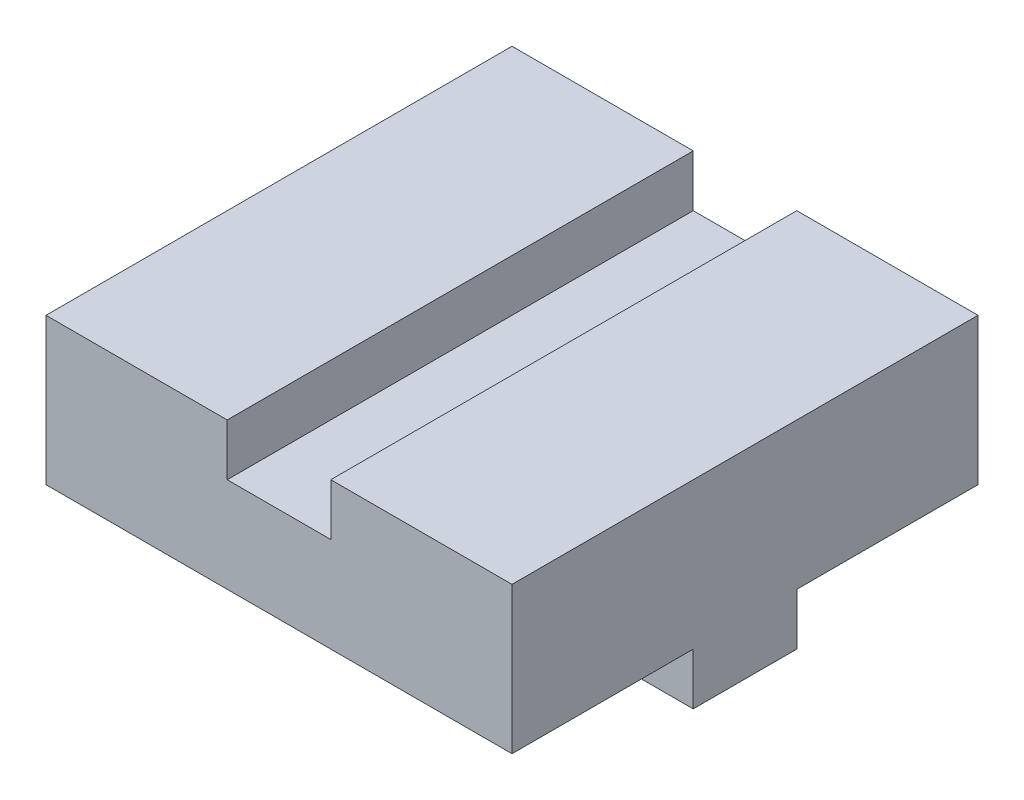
ISO-10303-21;
HEADER;
FILE_DESCRIPTION(('STEP AP214'),'2;1');
FILE_NAME('part.step','',(''),(''),'','','');
FILE_SCHEMA(('AUTOMOTIVE_DESIGN { 1 0 10303 214 1 1 1 1 }'));
ENDSEC;
DATA;
#1=APPLICATION_CONTEXT('core data for automotive mechanical design processes');
#2=APPLICATION_PROTOCOL_DEFINITION('international standard','automotive_design',2000,#1);
#3=PRODUCT_CONTEXT('',#1,'mechanical');
#4=PRODUCT('Part','Part','',(#3));
#5=PRODUCT_RELATED_PRODUCT_CATEGORY('part','',(#4));
#6=PRODUCT_DEFINITION_FORMATION('','',#4);
#7=PRODUCT_DEFINITION_CONTEXT('part definition',#1,'design');
#8=PRODUCT_DEFINITION('design','',#6,#7);
#9=PRODUCT_DEFINITION_SHAPE('','',#8);
#10=(LENGTH_UNIT() NAMED_UNIT(*) SI_UNIT(.MILLI.,.METRE.));
#11=(NAMED_UNIT(*) PLANE_ANGLE_UNIT() SI_UNIT($,.RADIAN.));
#12=(NAMED_UNIT(*) SI_UNIT($,.STERADIAN.) SOLID_ANGLE_UNIT());
#13=UNCERTAINTY_MEASURE_WITH_UNIT(LENGTH_MEASURE(1.E-05),#10,'distance_accuracy_value','');
#14=(GEOMETRIC_REPRESENTATION_CONTEXT(3) GLOBAL_UNCERTAINTY_ASSIGNED_CONTEXT((#13)) GLOBAL_UNIT_ASSIGNED_CONTEXT((#10,
#11,#12)) REPRESENTATION_CONTEXT('',''));
#15=CARTESIAN_POINT('',(0.,0.,0.));
#16=DIRECTION('',(0.,0.,1.));
#17=DIRECTION('',(1.,0.,0.));
#18=AXIS2_PLACEMENT_3D('',#15,#16,#17);
#19=CARTESIAN_POINT('',(0.,0.,0.));
#20=DIRECTION('',(0.,1.,0.));
#21=DIRECTION('',(0.,0.,1.));
#22=AXIS2_PLACEMENT_3D('',#19,#20,#21);
#23=PLANE('',#22);
#24=DIRECTION('',(1.,0.,0.));
#25=VECTOR('',#24,1.);
#26=CARTESIAN_POINT('',(-67.3606797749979,0.,-10.));
#27=LINE('',#26,#25);
#28=CARTESIAN_POINT('',(-45.,0.,-9.99999999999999));
#29=VERTEX_POINT('',#28);
#30=CARTESIAN_POINT('',(45.,0.,-10.));
#31=VERTEX_POINT('',#30);
#32=EDGE_CURVE('E176',#29,#31,#27,.T.);
#33=ORIENTED_EDGE('',*,*,#32,.F.);
#34=DIRECTION('',(0.,0.,1.));
#35=VECTOR('',#34,1.);
#36=CARTESIAN_POINT('',(-45.,0.,45.));
#37=LINE('',#36,#35);
#38=CARTESIAN_POINT('',(-45.,0.,-45.));
#39=VERTEX_POINT('',#38);
#40=EDGE_CURVE('E240',#39,#29,#37,.T.);
#41=ORIENTED_EDGE('',*,*,#40,.F.);
#42=DIRECTION('',(-1.,0.,0.));
#43=VECTOR('',#42,1.);
#44=CARTESIAN_POINT('',(45.,0.,-45.));
#45=LINE('',#44,#43);
#46=CARTESIAN_POINT('',(45.,0.,-45.));
#47=VERTEX_POINT('',#46);
#48=EDGE_CURVE('E226',#47,#39,#45,.T.);
#49=ORIENTED_EDGE('',*,*,#48,.F.);
#50=DIRECTION('',(0.,0.,-1.));
#51=VECTOR('',#50,1.);
#52=CARTESIAN_POINT('',(45.,0.,45.));
#53=LINE('',#52,#51);
#54=EDGE_CURVE('E247',#31,#47,#53,.T.);
#55=ORIENTED_EDGE('',*,*,#54,.F.);
#56=EDGE_LOOP('',(#33,#41,#49,#55));
#57=FACE_BOUND('',#56,.T.);
#58=ADVANCED_FACE('F51',(#57),#23,.F.);
#59=CARTESIAN_POINT('',(0.,28.3333333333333,0.));
#60=DIRECTION('',(0.,1.,0.));
#61=DIRECTION('',(0.,0.,1.));
#62=AXIS2_PLACEMENT_3D('',#59,#60,#61);
#63=PLANE('',#62);
#64=DIRECTION('',(0.,0.,1.));
#65=VECTOR('',#64,1.);
#66=CARTESIAN_POINT('',(-9.99999999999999,28.3333333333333,-45.));
#67=LINE('',#66,#65);
#68=CARTESIAN_POINT('',(-9.99999999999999,28.3333333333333,-45.));
#69=VERTEX_POINT('',#68);
#70=CARTESIAN_POINT('',(-9.99999999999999,28.3333333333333,45.));
#71=VERTEX_POINT('',#70);
#72=EDGE_CURVE('E209',#69,#71,#67,.T.);
#73=ORIENTED_EDGE('',*,*,#72,.F.);
#74=DIRECTION('',(-1.,0.,0.));
#75=VECTOR('',#74,1.);
#76=CARTESIAN_POINT('',(45.,28.3333333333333,-45.));
#77=LINE('',#76,#75);
#78=CARTESIAN_POINT('',(-45.,28.3333333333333,-45.));
#79=VERTEX_POINT('',#78);
#80=EDGE_CURVE('E234',#69,#79,#77,.T.);
#81=ORIENTED_EDGE('',*,*,#80,.T.);
#82=DIRECTION('',(0.,0.,1.));
#83=VECTOR('',#82,1.);
#84=CARTESIAN_POINT('',(-45.,28.3333333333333,45.));
#85=LINE('',#84,#83);
#86=CARTESIAN_POINT('',(-45.,28.3333333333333,45.));
#87=VERTEX_POINT('',#86);
#88=EDGE_CURVE('E221',#79,#87,#85,.T.);
#89=ORIENTED_EDGE('',*,*,#88,.T.);
#90=DIRECTION('',(1.,0.,0.));
#91=VECTOR('',#90,1.);
#92=CARTESIAN_POINT('',(45.,28.3333333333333,45.));
#93=LINE('',#92,#91);
#94=EDGE_CURVE('E227',#87,#71,#93,.T.);
#95=ORIENTED_EDGE('',*,*,#94,.T.);
#96=EDGE_LOOP('',(#73,#81,#89,#95));
#97=FACE_BOUND('',#96,.T.);
#98=ADVANCED_FACE('F287',(#97),#63,.T.);
#99=CARTESIAN_POINT('',(-45.,28.3333333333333,45.));
#100=DIRECTION('',(1.,0.,0.));
#101=DIRECTION('',(0.,0.,-1.));
#102=AXIS2_PLACEMENT_3D('',#99,#100,#101);
#103=PLANE('',#102);
#104=ORIENTED_EDGE('',*,*,#40,.T.);
#105=DIRECTION('',(0.,-1.,0.));
#106=VECTOR('',#105,1.);
#107=CARTESIAN_POINT('',(-45.,0.,-10.));
#108=LINE('',#107,#106);
#109=CARTESIAN_POINT('',(-45.,-10.,-10.));
#110=VERTEX_POINT('',#109);
#111=EDGE_CURVE('E175',#29,#110,#108,.T.);
#112=ORIENTED_EDGE('',*,*,#111,.T.);
#113=DIRECTION('',(0.,0.,1.));
#114=VECTOR('',#113,1.);
#115=CARTESIAN_POINT('',(-45.,-10.,10.));
#116=LINE('',#115,#114);
#117=CARTESIAN_POINT('',(-45.,-10.,10.));
#118=VERTEX_POINT('',#117);
#119=EDGE_CURVE('E182',#110,#118,#116,.T.);
#120=ORIENTED_EDGE('',*,*,#119,.T.);
#121=DIRECTION('',(0.,1.,0.));
#122=VECTOR('',#121,1.);
#123=CARTESIAN_POINT('',(-45.,0.,10.));
#124=LINE('',#123,#122);
#125=CARTESIAN_POINT('',(-45.,0.,10.));
#126=VERTEX_POINT('',#125);
#127=EDGE_CURVE('E147',#118,#126,#124,.T.);
#128=ORIENTED_EDGE('',*,*,#127,.T.);
#129=CARTESIAN_POINT('',(-45.,0.,45.));
#130=VERTEX_POINT('',#129);
#131=EDGE_CURVE('E72',#126,#130,#37,.T.);
#132=ORIENTED_EDGE('',*,*,#131,.T.);
#133=DIRECTION('',(0.,-1.,0.));
#134=VECTOR('',#133,1.);
#135=CARTESIAN_POINT('',(-45.,28.3333333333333,45.));
#136=LINE('',#135,#134);
#137=EDGE_CURVE('E11',#87,#130,#136,.T.);
#138=ORIENTED_EDGE('',*,*,#137,.F.);
#139=ORIENTED_EDGE('',*,*,#88,.F.);
#140=DIRECTION('',(0.,-1.,0.));
#141=VECTOR('',#140,1.);
#142=CARTESIAN_POINT('',(-45.,28.3333333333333,-45.));
#143=LINE('',#142,#141);
#144=EDGE_CURVE('E239',#79,#39,#143,.T.);
#145=ORIENTED_EDGE('',*,*,#144,.T.);
#146=EDGE_LOOP('',(#104,#112,#120,#128,#132,#138,#139,#145));
#147=FACE_BOUND('',#146,.T.);
#148=ADVANCED_FACE('F53',(#147),#103,.F.);
#149=CARTESIAN_POINT('',(45.,28.3333333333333,45.));
#150=DIRECTION('',(0.,0.,-1.));
#151=DIRECTION('',(-1.,0.,0.));
#152=AXIS2_PLACEMENT_3D('',#149,#150,#151);
#153=PLANE('',#152);
#154=DIRECTION('',(1.,0.,0.));
#155=VECTOR('',#154,1.);
#156=CARTESIAN_POINT('',(-10.,18.3333333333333,45.));
#157=LINE('',#156,#155);
#158=CARTESIAN_POINT('',(-10.,18.3333333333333,45.));
#159=VERTEX_POINT('',#158);
#160=CARTESIAN_POINT('',(10.,18.3333333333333,45.));
#161=VERTEX_POINT('',#160);
#162=EDGE_CURVE('E203',#159,#161,#157,.T.);
#163=ORIENTED_EDGE('',*,*,#162,.F.);
#164=DIRECTION('',(0.,-1.,0.));
#165=VECTOR('',#164,1.);
#166=CARTESIAN_POINT('',(-9.99999999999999,28.3333333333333,45.));
#167=LINE('',#166,#165);
#168=EDGE_CURVE('E185',#71,#159,#167,.T.);
#169=ORIENTED_EDGE('',*,*,#168,.F.);
#170=ORIENTED_EDGE('',*,*,#94,.F.);
#171=ORIENTED_EDGE('',*,*,#137,.T.);
#172=DIRECTION('',(1.,0.,0.));
#173=VECTOR('',#172,1.);
#174=CARTESIAN_POINT('',(45.,0.,45.));
#175=LINE('',#174,#173);
#176=CARTESIAN_POINT('',(45.,0.,45.));
#177=VERTEX_POINT('',#176);
#178=EDGE_CURVE('E244',#130,#177,#175,.T.);
#179=ORIENTED_EDGE('',*,*,#178,.T.);
#180=DIRECTION('',(0.,-1.,0.));
#181=VECTOR('',#180,1.);
#182=CARTESIAN_POINT('',(45.,28.3333333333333,45.));
#183=LINE('',#182,#181);
#184=CARTESIAN_POINT('',(45.,28.3333333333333,45.));
#185=VERTEX_POINT('',#184);
#186=EDGE_CURVE('E60',#185,#177,#183,.T.);
#187=ORIENTED_EDGE('',*,*,#186,.F.);
#188=CARTESIAN_POINT('',(10.,28.3333333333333,45.));
#189=VERTEX_POINT('',#188);
#190=EDGE_CURVE('E225',#189,#185,#93,.T.);
#191=ORIENTED_EDGE('',*,*,#190,.F.);
#192=DIRECTION('',(0.,1.,0.));
#193=VECTOR('',#192,1.);
#194=CARTESIAN_POINT('',(10.,28.3333333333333,45.));
#195=LINE('',#194,#193);
#196=EDGE_CURVE('E191',#161,#189,#195,.T.);
#197=ORIENTED_EDGE('',*,*,#196,.F.);
#198=EDGE_LOOP('',(#163,#169,#170,#171,#179,#187,#191,#197));
#199=FACE_BOUND('',#198,.T.);
#200=ADVANCED_FACE('F267',(#199),#153,.F.);
#201=CARTESIAN_POINT('',(45.,28.3333333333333,45.));
#202=DIRECTION('',(-1.,0.,0.));
#203=DIRECTION('',(0.,0.,1.));
#204=AXIS2_PLACEMENT_3D('',#201,#202,#203);
#205=PLANE('',#204);
#206=CARTESIAN_POINT('',(45.,0.,10.));
#207=VERTEX_POINT('',#206);
#208=EDGE_CURVE('E165',#177,#207,#53,.T.);
#209=ORIENTED_EDGE('',*,*,#208,.T.);
#210=DIRECTION('',(0.,-1.,0.));
#211=VECTOR('',#210,1.);
#212=CARTESIAN_POINT('',(45.,0.,10.));
#213=LINE('',#212,#211);
#214=CARTESIAN_POINT('',(45.,-10.,10.));
#215=VERTEX_POINT('',#214);
#216=EDGE_CURVE('E146',#207,#215,#213,.T.);
#217=ORIENTED_EDGE('',*,*,#216,.T.);
#218=DIRECTION('',(0.,0.,-1.));
#219=VECTOR('',#218,1.);
#220=CARTESIAN_POINT('',(45.,-10.,10.));
#221=LINE('',#220,#219);
#222=CARTESIAN_POINT('',(45.,-10.,-10.));
#223=VERTEX_POINT('',#222);
#224=EDGE_CURVE('E155',#215,#223,#221,.T.);
#225=ORIENTED_EDGE('',*,*,#224,.T.);
#226=DIRECTION('',(0.,1.,0.));
#227=VECTOR('',#226,1.);
#228=CARTESIAN_POINT('',(45.,0.,-10.));
#229=LINE('',#228,#227);
#230=EDGE_CURVE('E152',#223,#31,#229,.T.);
#231=ORIENTED_EDGE('',*,*,#230,.T.);
#232=ORIENTED_EDGE('',*,*,#54,.T.);
#233=DIRECTION('',(0.,-1.,0.));
#234=VECTOR('',#233,1.);
#235=CARTESIAN_POINT('',(45.,28.3333333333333,-45.));
#236=LINE('',#235,#234);
#237=CARTESIAN_POINT('',(45.,28.3333333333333,-45.));
#238=VERTEX_POINT('',#237);
#239=EDGE_CURVE('E255',#238,#47,#236,.T.);
#240=ORIENTED_EDGE('',*,*,#239,.F.);
#241=DIRECTION('',(0.,0.,-1.));
#242=VECTOR('',#241,1.);
#243=CARTESIAN_POINT('',(45.,28.3333333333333,45.));
#244=LINE('',#243,#242);
#245=EDGE_CURVE('E231',#185,#238,#244,.T.);
#246=ORIENTED_EDGE('',*,*,#245,.F.);
#247=ORIENTED_EDGE('',*,*,#186,.T.);
#248=EDGE_LOOP('',(#209,#217,#225,#231,#232,#240,#246,#247));
#249=FACE_BOUND('',#248,.T.);
#250=ADVANCED_FACE('F163',(#249),#205,.F.);
#251=CARTESIAN_POINT('',(45.,28.3333333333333,-45.));
#252=DIRECTION('',(0.,0.,1.));
#253=DIRECTION('',(1.,0.,0.));
#254=AXIS2_PLACEMENT_3D('',#251,#252,#253);
#255=PLANE('',#254);
#256=ORIENTED_EDGE('',*,*,#80,.F.);
#257=DIRECTION('',(0.,-1.,0.));
#258=VECTOR('',#257,1.);
#259=CARTESIAN_POINT('',(-9.99999999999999,28.3333333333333,-45.));
#260=LINE('',#259,#258);
#261=CARTESIAN_POINT('',(-10.,18.3333333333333,-45.));
#262=VERTEX_POINT('',#261);
#263=EDGE_CURVE('E186',#69,#262,#260,.T.);
#264=ORIENTED_EDGE('',*,*,#263,.T.);
#265=DIRECTION('',(1.,0.,0.));
#266=VECTOR('',#265,1.);
#267=CARTESIAN_POINT('',(-10.,18.3333333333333,-45.));
#268=LINE('',#267,#266);
#269=CARTESIAN_POINT('',(10.,18.3333333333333,-45.));
#270=VERTEX_POINT('',#269);
#271=EDGE_CURVE('E190',#262,#270,#268,.T.);
#272=ORIENTED_EDGE('',*,*,#271,.T.);
#273=DIRECTION('',(0.,1.,0.));
#274=VECTOR('',#273,1.);
#275=CARTESIAN_POINT('',(10.,28.3333333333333,-45.));
#276=LINE('',#275,#274);
#277=CARTESIAN_POINT('',(10.,28.3333333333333,-45.));
#278=VERTEX_POINT('',#277);
#279=EDGE_CURVE('E195',#270,#278,#276,.T.);
#280=ORIENTED_EDGE('',*,*,#279,.T.);
#281=EDGE_CURVE('E235',#238,#278,#77,.T.);
#282=ORIENTED_EDGE('',*,*,#281,.F.);
#283=ORIENTED_EDGE('',*,*,#239,.T.);
#284=ORIENTED_EDGE('',*,*,#48,.T.);
#285=ORIENTED_EDGE('',*,*,#144,.F.);
#286=EDGE_LOOP('',(#256,#264,#272,#280,#282,#283,#284,#285));
#287=FACE_BOUND('',#286,.T.);
#288=ADVANCED_FACE('F284',(#287),#255,.F.);
#289=DIRECTION('',(0.,0.,1.));
#290=VECTOR('',#289,1.);
#291=CARTESIAN_POINT('',(10.,28.3333333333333,-45.));
#292=LINE('',#291,#290);
#293=EDGE_CURVE('E212',#278,#189,#292,.T.);
#294=ORIENTED_EDGE('',*,*,#293,.T.);
#295=ORIENTED_EDGE('',*,*,#190,.T.);
#296=ORIENTED_EDGE('',*,*,#245,.T.);
#297=ORIENTED_EDGE('',*,*,#281,.T.);
#298=EDGE_LOOP('',(#294,#295,#296,#297));
#299=FACE_BOUND('',#298,.T.);
#300=ADVANCED_FACE('F296',(#299),#63,.T.);
#301=ORIENTED_EDGE('',*,*,#131,.F.);
#302=DIRECTION('',(1.,0.,0.));
#303=VECTOR('',#302,1.);
#304=CARTESIAN_POINT('',(-67.3606797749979,0.,10.));
#305=LINE('',#304,#303);
#306=EDGE_CURVE('E67',#126,#207,#305,.T.);
#307=ORIENTED_EDGE('',*,*,#306,.T.);
#308=ORIENTED_EDGE('',*,*,#208,.F.);
#309=ORIENTED_EDGE('',*,*,#178,.F.);
#310=EDGE_LOOP('',(#301,#307,#308,#309));
#311=FACE_BOUND('',#310,.T.);
#312=ADVANCED_FACE('F264',(#311),#23,.F.);
#313=CARTESIAN_POINT('',(-9.99999999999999,28.3333333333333,-45.));
#314=DIRECTION('',(-1.,0.,0.));
#315=DIRECTION('',(0.,-1.,0.));
#316=AXIS2_PLACEMENT_3D('',#313,#314,#315);
#317=PLANE('',#316);
#318=ORIENTED_EDGE('',*,*,#168,.T.);
#319=DIRECTION('',(0.,0.,1.));
#320=VECTOR('',#319,1.);
#321=CARTESIAN_POINT('',(-10.,18.3333333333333,-45.));
#322=LINE('',#321,#320);
#323=EDGE_CURVE('E199',#262,#159,#322,.T.);
#324=ORIENTED_EDGE('',*,*,#323,.F.);
#325=ORIENTED_EDGE('',*,*,#263,.F.);
#326=ORIENTED_EDGE('',*,*,#72,.T.);
#327=EDGE_LOOP('',(#318,#324,#325,#326));
#328=FACE_BOUND('',#327,.T.);
#329=ADVANCED_FACE('F298',(#328),#317,.F.);
#330=CARTESIAN_POINT('',(10.,28.3333333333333,-45.));
#331=DIRECTION('',(1.,0.,0.));
#332=DIRECTION('',(0.,1.,0.));
#333=AXIS2_PLACEMENT_3D('',#330,#331,#332);
#334=PLANE('',#333);
#335=ORIENTED_EDGE('',*,*,#196,.T.);
#336=ORIENTED_EDGE('',*,*,#293,.F.);
#337=ORIENTED_EDGE('',*,*,#279,.F.);
#338=DIRECTION('',(0.,0.,1.));
#339=VECTOR('',#338,1.);
#340=CARTESIAN_POINT('',(10.,18.3333333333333,-45.));
#341=LINE('',#340,#339);
#342=EDGE_CURVE('E216',#270,#161,#341,.T.);
#343=ORIENTED_EDGE('',*,*,#342,.T.);
#344=EDGE_LOOP('',(#335,#336,#337,#343));
#345=FACE_BOUND('',#344,.T.);
#346=ADVANCED_FACE('F302',(#345),#334,.F.);
#347=CARTESIAN_POINT('',(-10.,18.3333333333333,-45.));
#348=DIRECTION('',(0.,-1.,0.));
#349=DIRECTION('',(0.,0.,-1.));
#350=AXIS2_PLACEMENT_3D('',#347,#348,#349);
#351=PLANE('',#350);
#352=ORIENTED_EDGE('',*,*,#162,.T.);
#353=ORIENTED_EDGE('',*,*,#342,.F.);
#354=ORIENTED_EDGE('',*,*,#271,.F.);
#355=ORIENTED_EDGE('',*,*,#323,.T.);
#356=EDGE_LOOP('',(#352,#353,#354,#355));
#357=FACE_BOUND('',#356,.T.);
#358=ADVANCED_FACE('F311',(#357),#351,.F.);
#359=CARTESIAN_POINT('',(-67.3606797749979,0.,10.));
#360=DIRECTION('',(0.,0.,1.));
#361=DIRECTION('',(1.,0.,0.));
#362=AXIS2_PLACEMENT_3D('',#359,#360,#361);
#363=PLANE('',#362);
#364=ORIENTED_EDGE('',*,*,#127,.F.);
#365=DIRECTION('',(1.,0.,0.));
#366=VECTOR('',#365,1.);
#367=CARTESIAN_POINT('',(-67.3606797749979,-10.,10.));
#368=LINE('',#367,#366);
#369=EDGE_CURVE('E142',#118,#215,#368,.T.);
#370=ORIENTED_EDGE('',*,*,#369,.T.);
#371=ORIENTED_EDGE('',*,*,#216,.F.);
#372=ORIENTED_EDGE('',*,*,#306,.F.);
#373=EDGE_LOOP('',(#364,#370,#371,#372));
#374=FACE_BOUND('',#373,.T.);
#375=ADVANCED_FACE('F144',(#374),#363,.T.);
#376=CARTESIAN_POINT('',(-67.3606797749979,0.,-10.));
#377=DIRECTION('',(0.,0.,-1.));
#378=DIRECTION('',(0.,1.,0.));
#379=AXIS2_PLACEMENT_3D('',#376,#377,#378);
#380=PLANE('',#379);
#381=ORIENTED_EDGE('',*,*,#111,.F.);
#382=ORIENTED_EDGE('',*,*,#32,.T.);
#383=ORIENTED_EDGE('',*,*,#230,.F.);
#384=DIRECTION('',(1.,0.,0.));
#385=VECTOR('',#384,1.);
#386=CARTESIAN_POINT('',(-67.3606797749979,-10.,-10.));
#387=LINE('',#386,#385);
#388=EDGE_CURVE('E151',#110,#223,#387,.T.);
#389=ORIENTED_EDGE('',*,*,#388,.F.);
#390=EDGE_LOOP('',(#381,#382,#383,#389));
#391=FACE_BOUND('',#390,.T.);
#392=ADVANCED_FACE('F277',(#391),#380,.T.);
#393=CARTESIAN_POINT('',(-67.3606797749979,-10.,10.));
#394=DIRECTION('',(0.,-1.,0.));
#395=DIRECTION('',(0.,0.,-1.));
#396=AXIS2_PLACEMENT_3D('',#393,#394,#395);
#397=PLANE('',#396);
#398=ORIENTED_EDGE('',*,*,#119,.F.);
#399=ORIENTED_EDGE('',*,*,#388,.T.);
#400=ORIENTED_EDGE('',*,*,#224,.F.);
#401=ORIENTED_EDGE('',*,*,#369,.F.);
#402=EDGE_LOOP('',(#398,#399,#400,#401));
#403=FACE_BOUND('',#402,.T.);
#404=ADVANCED_FACE('F156',(#403),#397,.T.);
#405=CLOSED_SHELL('',(#58,#98,#148,#200,#250,#288,#300,#312,#329,#346,#358,#375,#392,#404));
#406=MANIFOLD_SOLID_BREP('B2',#405);
#407=ADVANCED_BREP_SHAPE_REPRESENTATION('',(#18,#406),#14);
#408=SHAPE_DEFINITION_REPRESENTATION(#9,#407);
ENDSEC;
END-ISO-10303-21;
